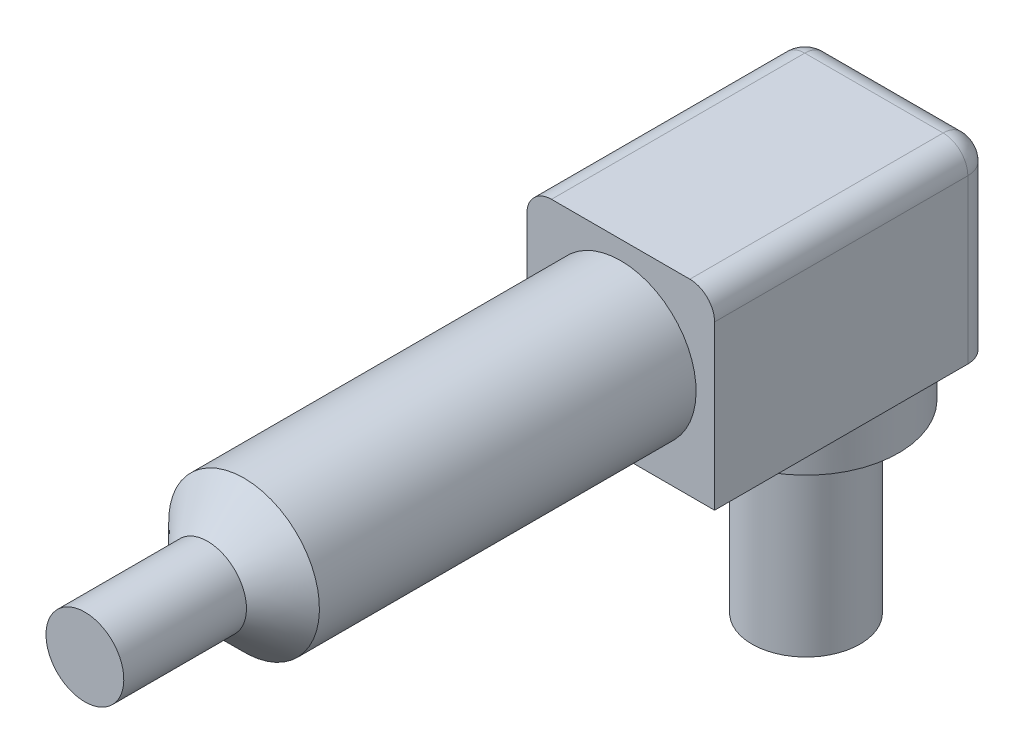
from build123d import *

# Parameters (mm, degrees)
SKETCH2_W           = 19.304
SKETCH2_H           = 19.304
BOSS_EXTRUDE1_DEPTH = 28.575
FILLET1_R           = 2.54


with BuildPart() as part:
    # Sketch2 → Boss-Extrude1 (new body)
    with BuildSketch(Plane.XY):
        Rectangle(SKETCH2_W, SKETCH2_H)
    extrude(amount=BOSS_EXTRUDE1_DEPTH)

    # Sketch3 → Revolve1 (revolve)
    with BuildSketch(Plane(origin=(0, 0, 0), x_dir=(0, 0, -1), z_dir=(1, 0, 0)), mode=Mode.PRIVATE) as revolve1_sk:
        Polygon((-9.525, -9.652), (0, -9.652), (0, -14.148), (-3.96875, -14.148), (-3.96875, -33.148), (-9.525, -33.148), align=None)
    revolve(revolve1_sk.sketch.rotate(Axis((0, -9.652, 9.525), (0, -1, 0)), 180), axis=Axis((0, -9.652, 9.525), (0, -1, 0)))

    # Sketch4 → Revolve2 (revolve)
    with BuildSketch(Plane(origin=(0, 0, 0), x_dir=(0, 0, -1), z_dir=(1, 0, 0))):
        Polygon((-28.575, 7.75), (-42.3, 7.75), (-67.3, 7.75), (-71.05, 4), (-83.661213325, 4), (-83.661213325, 0), (-28.575, 0), align=None)
    revolve(axis=Axis((0, 0, 0), (0, 0, 1)))

    # Fillet1
    fillet1_edges = [part.edges().sort_by_distance(p)[0] for p in [
        (-9.652, 0, 0),
        (0, 9.652, 0),
        (9.652, 0, 0),
        (-9.652, 9.652, 14.2875),
        (9.652, 9.652, 14.2875),
    ]]
    fillet(fillet1_edges, radius=FILLET1_R)


solid = part.part
